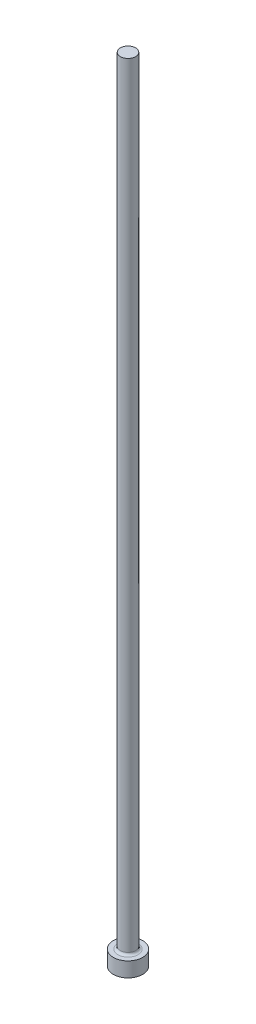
from build123d import *


with BuildPart() as part:
    # Sketch1 → Revolve1 (revolve)
    with BuildSketch(Plane.XY, mode=Mode.PRIVATE) as revolve1_sk:
        with BuildLine():
            Line((0, 0), (4.699, 0))
            Line((4.699, 0), (4.699, 4.7498))
            Line((4.699, 4.7498), (3.20675, 4.7498))
            ThreePointArc((3.20675, 4.7498), (2.667934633, 4.972984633), (2.44475, 5.5118))
            Line((2.44475, 5.5118), (2.44475, 254))
            Line((2.44475, 254), (0, 254))
            Line((0, 254), (0, 0))
        make_face()
    revolve(revolve1_sk.sketch.rotate(Axis((0, 254, 0), (0, -1, 0)), 180), axis=Axis((0, 254, 0), (0, -1, 0)))


solid = part.part
